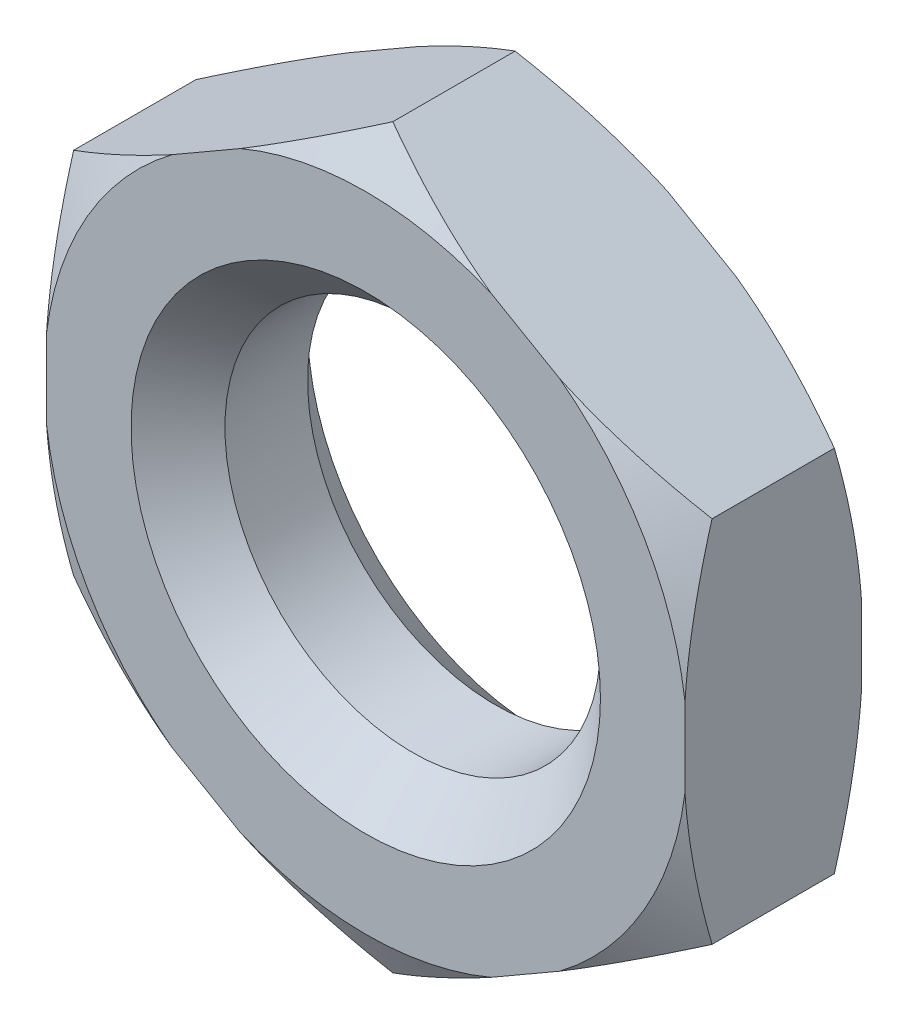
from build123d import *

# Parameters (mm, degrees)
BOSS_EXTRUDE1_DEPTH = 2.35
SKETCH6_R           = 5
CUT_EXTRUDE1_DEPTH  = 4.7
CHAMFER1_SIZE       = 1.25


with BuildPart() as part:
    # Sketch3 → Boss-Extrude1 (new, symmetric)
    with BuildSketch(Plane.XY):
        Polygon((0, 9.814954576), (-8.5, 4.907477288), (-8.5, -4.907477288), (0, -9.814954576), (8.5, -4.907477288), (8.5, 4.907477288), align=None)
    extrude(amount=BOSS_EXTRUDE1_DEPTH, both=True)

    # Sketch5 → Cut-Revolve1 (revolve, cut)
    with BuildSketch(Plane(origin=(0, 0, 0), x_dir=(0, 0, -1), z_dir=(1, 0, 0))):
        Polygon((-2.35, 9.814954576), (-2.35, 8.564954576), (-1.628312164, 9.814954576), align=None)
    cut_revolve1 = revolve(axis=Axis((0, 0, 5.457798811), (0, 0, -1)), mode=Mode.SUBTRACT)

    # Mirror1: Cut-Revolve1 across plane
    add(cut_revolve1.mirror(Plane.XY), mode=Mode.SUBTRACT)

    # Sketch6 → Cut-Extrude1 (cut)
    with BuildSketch(Plane.XY.offset(2.35)):
        Circle(SKETCH6_R)
    extrude(amount=-CUT_EXTRUDE1_DEPTH, mode=Mode.SUBTRACT)

    # Chamfer1
    chamfer1_edges = [part.edges().sort_by_distance(p)[0] for p in [
        (-5, 0, -2.35),
        (-5, 0, 2.35),
    ]]
    chamfer(chamfer1_edges, length=CHAMFER1_SIZE)


solid = part.part
